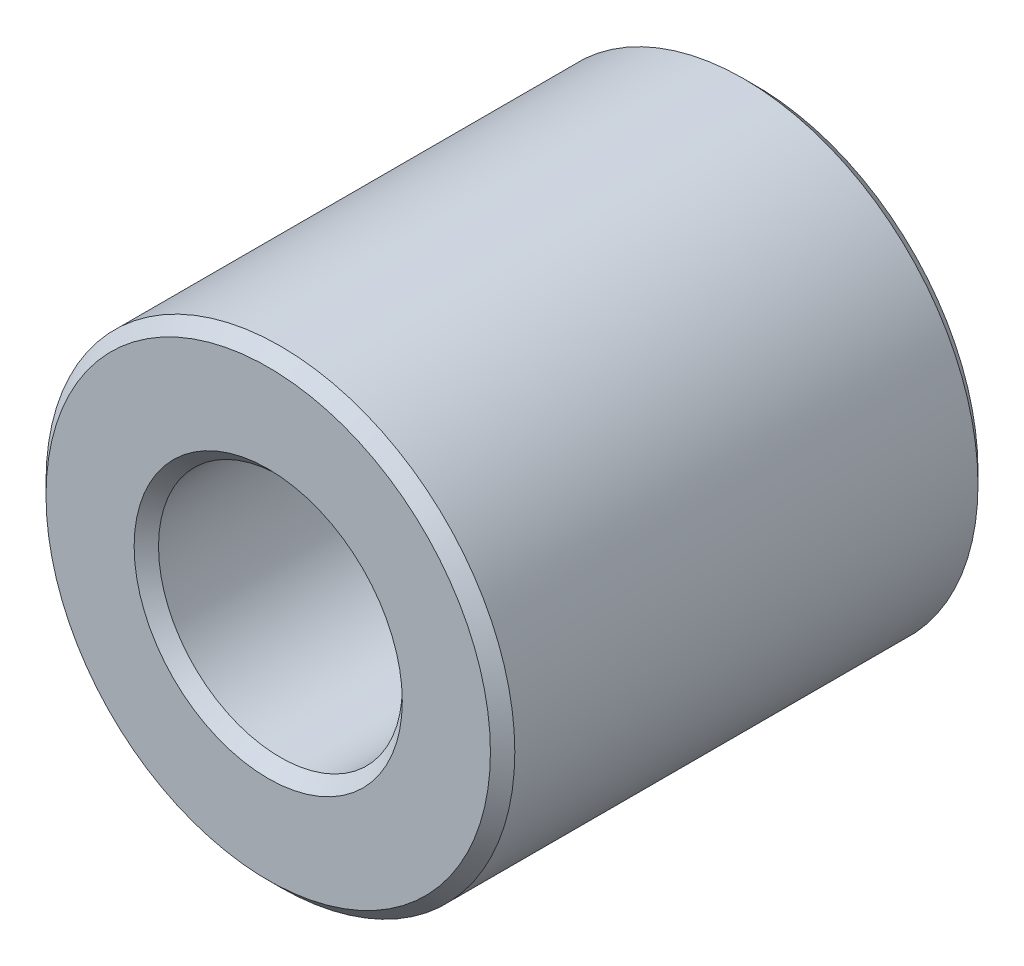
ISO-10303-21;
HEADER;
FILE_DESCRIPTION(('STEP AP214'),'2;1');
FILE_NAME('part.step','',(''),(''),'','','');
FILE_SCHEMA(('AUTOMOTIVE_DESIGN { 1 0 10303 214 1 1 1 1 }'));
ENDSEC;
DATA;
#1=APPLICATION_CONTEXT('core data for automotive mechanical design processes');
#2=APPLICATION_PROTOCOL_DEFINITION('international standard','automotive_design',2000,#1);
#3=PRODUCT_CONTEXT('',#1,'mechanical');
#4=PRODUCT('Part','Part','',(#3));
#5=PRODUCT_RELATED_PRODUCT_CATEGORY('part','',(#4));
#6=PRODUCT_DEFINITION_FORMATION('','',#4);
#7=PRODUCT_DEFINITION_CONTEXT('part definition',#1,'design');
#8=PRODUCT_DEFINITION('design','',#6,#7);
#9=PRODUCT_DEFINITION_SHAPE('','',#8);
#10=(LENGTH_UNIT() NAMED_UNIT(*) SI_UNIT(.MILLI.,.METRE.));
#11=(NAMED_UNIT(*) PLANE_ANGLE_UNIT() SI_UNIT($,.RADIAN.));
#12=(NAMED_UNIT(*) SI_UNIT($,.STERADIAN.) SOLID_ANGLE_UNIT());
#13=UNCERTAINTY_MEASURE_WITH_UNIT(LENGTH_MEASURE(1.E-05),#10,'distance_accuracy_value','');
#14=(GEOMETRIC_REPRESENTATION_CONTEXT(3) GLOBAL_UNCERTAINTY_ASSIGNED_CONTEXT((#13)) GLOBAL_UNIT_ASSIGNED_CONTEXT((#10,
#11,#12)) REPRESENTATION_CONTEXT('',''));
#15=CARTESIAN_POINT('',(0.,0.,0.));
#16=DIRECTION('',(0.,0.,1.));
#17=DIRECTION('',(1.,0.,0.));
#18=AXIS2_PLACEMENT_3D('',#15,#16,#17);
#19=CARTESIAN_POINT('',(0.,0.,26.));
#20=DIRECTION('',(0.,0.,1.));
#21=DIRECTION('',(1.,0.,0.));
#22=AXIS2_PLACEMENT_3D('',#19,#20,#21);
#23=PLANE('',#22);
#24=CARTESIAN_POINT('',(0.,0.,26.));
#25=DIRECTION('',(0.,0.,1.));
#26=DIRECTION('',(1.,0.,0.));
#27=AXIS2_PLACEMENT_3D('',#24,#25,#26);
#28=CIRCLE('',#27,14.3);
#29=CARTESIAN_POINT('',(14.3,0.,26.));
#30=VERTEX_POINT('',#29);
#31=EDGE_CURVE('E10',#30,#30,#28,.F.);
#32=ORIENTED_EDGE('',*,*,#31,.T.);
#33=EDGE_LOOP('',(#32));
#34=FACE_BOUND('',#33,.T.);
#35=CARTESIAN_POINT('',(0.,0.,26.));
#36=DIRECTION('',(0.,0.,1.));
#37=DIRECTION('',(1.,0.,0.));
#38=AXIS2_PLACEMENT_3D('',#35,#36,#37);
#39=CIRCLE('',#38,23.7);
#40=CARTESIAN_POINT('',(23.7,0.,26.));
#41=VERTEX_POINT('',#40);
#42=EDGE_CURVE('E45',#41,#41,#39,.T.);
#43=ORIENTED_EDGE('',*,*,#42,.T.);
#44=EDGE_LOOP('',(#43));
#45=FACE_BOUND('',#44,.T.);
#46=ADVANCED_FACE('F37',(#34,#45),#23,.T.);
#47=CARTESIAN_POINT('',(0.,0.,-26.));
#48=DIRECTION('',(0.,0.,1.));
#49=DIRECTION('',(1.,0.,0.));
#50=AXIS2_PLACEMENT_3D('',#47,#48,#49);
#51=PLANE('',#50);
#52=CARTESIAN_POINT('',(0.,0.,-26.));
#53=DIRECTION('',(0.,0.,1.));
#54=DIRECTION('',(1.,0.,0.));
#55=AXIS2_PLACEMENT_3D('',#52,#53,#54);
#56=CIRCLE('',#55,14.3);
#57=CARTESIAN_POINT('',(14.3,0.,-26.));
#58=VERTEX_POINT('',#57);
#59=EDGE_CURVE('E70',#58,#58,#56,.T.);
#60=ORIENTED_EDGE('',*,*,#59,.T.);
#61=EDGE_LOOP('',(#60));
#62=FACE_BOUND('',#61,.T.);
#63=CARTESIAN_POINT('',(0.,0.,-26.));
#64=DIRECTION('',(0.,0.,1.));
#65=DIRECTION('',(1.,0.,0.));
#66=AXIS2_PLACEMENT_3D('',#63,#64,#65);
#67=CIRCLE('',#66,23.7);
#68=CARTESIAN_POINT('',(23.7,0.,-26.));
#69=VERTEX_POINT('',#68);
#70=EDGE_CURVE('E74',#69,#69,#67,.F.);
#71=ORIENTED_EDGE('',*,*,#70,.T.);
#72=EDGE_LOOP('',(#71));
#73=FACE_BOUND('',#72,.T.);
#74=ADVANCED_FACE('F78',(#62,#73),#51,.F.);
#75=CARTESIAN_POINT('',(0.,0.,26.));
#76=DIRECTION('',(0.,0.,-1.));
#77=DIRECTION('',(-1.,0.,0.));
#78=AXIS2_PLACEMENT_3D('',#75,#76,#77);
#79=CYLINDRICAL_SURFACE('',#78,25.);
#80=CARTESIAN_POINT('',(0.,0.,-24.7));
#81=DIRECTION('',(0.,0.,1.));
#82=DIRECTION('',(1.,0.,0.));
#83=AXIS2_PLACEMENT_3D('',#80,#81,#82);
#84=CIRCLE('',#83,25.);
#85=CARTESIAN_POINT('',(-25.,0.,-24.7));
#86=VERTEX_POINT('',#85);
#87=EDGE_CURVE('E52',#86,#86,#84,.T.);
#88=CARTESIAN_POINT('',(0.,0.,24.7000000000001));
#89=DIRECTION('',(0.,0.,1.));
#90=DIRECTION('',(1.,0.,0.));
#91=AXIS2_PLACEMENT_3D('',#88,#89,#90);
#92=CIRCLE('',#91,25.);
#93=CARTESIAN_POINT('',(-25.,0.,24.7000000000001));
#94=VERTEX_POINT('',#93);
#95=EDGE_CURVE('E57',#94,#94,#92,.F.);
#96=CARTESIAN_POINT('',(-25.,0.,-24.7));
#97=CARTESIAN_POINT('',(-25.,0.,-24.1854166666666));
#98=CARTESIAN_POINT('',(-25.,0.,-23.6708333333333));
#99=CARTESIAN_POINT('',(-25.,0.,-22.6416666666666));
#100=CARTESIAN_POINT('',(-25.,0.,-22.1270833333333));
#101=CARTESIAN_POINT('',(-25.,0.,-21.0979166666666));
#102=CARTESIAN_POINT('',(-25.,0.,-20.5833333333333));
#103=CARTESIAN_POINT('',(-25.,0.,-19.5541666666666));
#104=CARTESIAN_POINT('',(-25.,0.,-19.0395833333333));
#105=CARTESIAN_POINT('',(-25.,0.,-18.0104166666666));
#106=CARTESIAN_POINT('',(-25.,0.,-17.4958333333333));
#107=CARTESIAN_POINT('',(-25.,0.,-16.4666666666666));
#108=CARTESIAN_POINT('',(-25.,0.,-15.9520833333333));
#109=CARTESIAN_POINT('',(-25.,0.,-14.9229166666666));
#110=CARTESIAN_POINT('',(-25.,0.,-14.4083333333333));
#111=CARTESIAN_POINT('',(-25.,0.,-13.3791666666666));
#112=CARTESIAN_POINT('',(-25.,0.,-12.8645833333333));
#113=CARTESIAN_POINT('',(-25.,0.,-11.8354166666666));
#114=CARTESIAN_POINT('',(-25.,0.,-11.3208333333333));
#115=CARTESIAN_POINT('',(-25.,0.,-10.2916666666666));
#116=CARTESIAN_POINT('',(-25.,0.,-9.7770833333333));
#117=CARTESIAN_POINT('',(-25.,0.,-8.74791666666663));
#118=CARTESIAN_POINT('',(-25.,0.,-8.2333333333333));
#119=CARTESIAN_POINT('',(-25.,0.,-7.20416666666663));
#120=CARTESIAN_POINT('',(-25.,0.,-6.6895833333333));
#121=CARTESIAN_POINT('',(-25.,0.,-5.66041666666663));
#122=CARTESIAN_POINT('',(-25.,0.,-5.1458333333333));
#123=CARTESIAN_POINT('',(-25.,0.,-4.11666666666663));
#124=CARTESIAN_POINT('',(-25.,0.,-3.6020833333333));
#125=CARTESIAN_POINT('',(-25.,0.,-2.57291666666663));
#126=CARTESIAN_POINT('',(-25.,0.,-2.0583333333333));
#127=CARTESIAN_POINT('',(-25.,0.,-1.02916666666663));
#128=CARTESIAN_POINT('',(-25.,0.,-0.514583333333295));
#129=CARTESIAN_POINT('',(-25.,0.,0.514583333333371));
#130=CARTESIAN_POINT('',(-25.,0.,1.0291666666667));
#131=CARTESIAN_POINT('',(-25.,0.,2.05833333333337));
#132=CARTESIAN_POINT('',(-25.,0.,2.57291666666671));
#133=CARTESIAN_POINT('',(-25.,0.,3.60208333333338));
#134=CARTESIAN_POINT('',(-25.,0.,4.11666666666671));
#135=CARTESIAN_POINT('',(-25.,0.,5.14583333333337));
#136=CARTESIAN_POINT('',(-25.,0.,5.66041666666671));
#137=CARTESIAN_POINT('',(-25.,0.,6.68958333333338));
#138=CARTESIAN_POINT('',(-25.,0.,7.20416666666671));
#139=CARTESIAN_POINT('',(-25.,0.,8.23333333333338));
#140=CARTESIAN_POINT('',(-25.,0.,8.74791666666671));
#141=CARTESIAN_POINT('',(-25.,0.,9.77708333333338));
#142=CARTESIAN_POINT('',(-25.,0.,10.2916666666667));
#143=CARTESIAN_POINT('',(-25.,0.,11.3208333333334));
#144=CARTESIAN_POINT('',(-25.,0.,11.8354166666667));
#145=CARTESIAN_POINT('',(-25.,0.,12.8645833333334));
#146=CARTESIAN_POINT('',(-25.,0.,13.3791666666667));
#147=CARTESIAN_POINT('',(-25.,0.,14.4083333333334));
#148=CARTESIAN_POINT('',(-25.,0.,14.9229166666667));
#149=CARTESIAN_POINT('',(-25.,0.,15.9520833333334));
#150=CARTESIAN_POINT('',(-25.,0.,16.4666666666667));
#151=CARTESIAN_POINT('',(-25.,0.,17.4958333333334));
#152=CARTESIAN_POINT('',(-25.,0.,18.0104166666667));
#153=CARTESIAN_POINT('',(-25.,0.,19.0395833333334));
#154=CARTESIAN_POINT('',(-25.,0.,19.5541666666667));
#155=CARTESIAN_POINT('',(-25.,0.,20.5833333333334));
#156=CARTESIAN_POINT('',(-25.,0.,21.0979166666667));
#157=CARTESIAN_POINT('',(-25.,0.,22.1270833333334));
#158=CARTESIAN_POINT('',(-25.,0.,22.6416666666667));
#159=CARTESIAN_POINT('',(-25.,0.,23.6708333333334));
#160=CARTESIAN_POINT('',(-25.,0.,24.1854166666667));
#161=CARTESIAN_POINT('',(-25.,0.,24.7000000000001));
#162=B_SPLINE_CURVE_WITH_KNOTS('',3,(#96,#97,#98,#99,#100,#101,#102,#103,#104,#105,#106,#107,
#108,#109,#110,#111,#112,#113,#114,#115,#116,#117,#118,#119,#120,#121,#122,#123,#124,#125,#126,
#127,#128,#129,#130,#131,#132,#133,#134,#135,#136,#137,#138,#139,#140,#141,#142,#143,#144,#145,
#146,#147,#148,#149,#150,#151,#152,#153,#154,#155,#156,#157,#158,#159,#160,#161),.UNSPECIFIED.,
.F.,.F.,(4,2,2,2,2,2,2,2,2,2,2,2,2,2,2,2,2,2,2,2,2,2,2,2,2,2,2,2,2,2,2,2,4),(0.,1.54375,3.0875,
4.63125,6.17500000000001,7.71875,9.26250000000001,10.80625,12.35,13.89375,15.4375,16.98125,
18.525,20.06875,21.6125,23.15625,24.7,26.24375,27.7875,29.33125,30.875,32.41875,33.9625,
35.50625,37.05,38.59375,40.1375,41.68125,43.225,44.76875,46.3125,47.85625,49.4),.UNSPECIFIED.);
#163=EDGE_CURVE('BSEAM88',#86,#94,#162,.T.);
#164=ORIENTED_EDGE('',*,*,#87,.T.);
#165=ORIENTED_EDGE('',*,*,#95,.T.);
#166=ORIENTED_EDGE('',*,*,#163,.T.);
#167=ORIENTED_EDGE('',*,*,#163,.F.);
#168=EDGE_LOOP('',(#164,#166,#165,#167));
#169=FACE_BOUND('',#168,.T.);
#170=ADVANCED_FACE('F88',(#169),#79,.T.);
#171=CARTESIAN_POINT('',(0.,0.,26.));
#172=DIRECTION('',(0.,0.,-1.));
#173=DIRECTION('',(-1.,0.,0.));
#174=AXIS2_PLACEMENT_3D('',#171,#172,#173);
#175=CYLINDRICAL_SURFACE('',#174,13.);
#176=CARTESIAN_POINT('',(0.,0.,-24.7));
#177=DIRECTION('',(0.,0.,1.));
#178=DIRECTION('',(1.,0.,0.));
#179=AXIS2_PLACEMENT_3D('',#176,#177,#178);
#180=CIRCLE('',#179,13.);
#181=CARTESIAN_POINT('',(-13.,0.,-24.7));
#182=VERTEX_POINT('',#181);
#183=EDGE_CURVE('E63',#182,#182,#180,.F.);
#184=CARTESIAN_POINT('',(0.,0.,24.7));
#185=DIRECTION('',(0.,0.,1.));
#186=DIRECTION('',(1.,0.,0.));
#187=AXIS2_PLACEMENT_3D('',#184,#185,#186);
#188=CIRCLE('',#187,13.);
#189=CARTESIAN_POINT('',(-13.,0.,24.7));
#190=VERTEX_POINT('',#189);
#191=EDGE_CURVE('E66',#190,#190,#188,.T.);
#192=CARTESIAN_POINT('',(-13.,0.,-24.7));
#193=CARTESIAN_POINT('',(-13.,0.,-24.1854166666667));
#194=CARTESIAN_POINT('',(-13.,0.,-23.6708333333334));
#195=CARTESIAN_POINT('',(-13.,0.,-22.6416666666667));
#196=CARTESIAN_POINT('',(-13.,0.,-22.1270833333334));
#197=CARTESIAN_POINT('',(-13.,0.,-21.0979166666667));
#198=CARTESIAN_POINT('',(-13.,0.,-20.5833333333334));
#199=CARTESIAN_POINT('',(-13.,0.,-19.5541666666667));
#200=CARTESIAN_POINT('',(-13.,0.,-19.0395833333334));
#201=CARTESIAN_POINT('',(-13.,0.,-18.0104166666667));
#202=CARTESIAN_POINT('',(-13.,0.,-17.4958333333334));
#203=CARTESIAN_POINT('',(-13.,0.,-16.4666666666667));
#204=CARTESIAN_POINT('',(-13.,0.,-15.9520833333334));
#205=CARTESIAN_POINT('',(-13.,0.,-14.9229166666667));
#206=CARTESIAN_POINT('',(-13.,0.,-14.4083333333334));
#207=CARTESIAN_POINT('',(-13.,0.,-13.3791666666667));
#208=CARTESIAN_POINT('',(-13.,0.,-12.8645833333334));
#209=CARTESIAN_POINT('',(-13.,0.,-11.8354166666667));
#210=CARTESIAN_POINT('',(-13.,0.,-11.3208333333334));
#211=CARTESIAN_POINT('',(-13.,0.,-10.2916666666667));
#212=CARTESIAN_POINT('',(-13.,0.,-9.77708333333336));
#213=CARTESIAN_POINT('',(-13.,0.,-8.7479166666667));
#214=CARTESIAN_POINT('',(-13.,0.,-8.23333333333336));
#215=CARTESIAN_POINT('',(-13.,0.,-7.2041666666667));
#216=CARTESIAN_POINT('',(-13.,0.,-6.68958333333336));
#217=CARTESIAN_POINT('',(-13.,0.,-5.6604166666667));
#218=CARTESIAN_POINT('',(-13.,0.,-5.14583333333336));
#219=CARTESIAN_POINT('',(-13.,0.,-4.1166666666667));
#220=CARTESIAN_POINT('',(-13.,0.,-3.60208333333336));
#221=CARTESIAN_POINT('',(-13.,0.,-2.5729166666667));
#222=CARTESIAN_POINT('',(-13.,0.,-2.05833333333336));
#223=CARTESIAN_POINT('',(-13.,0.,-1.0291666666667));
#224=CARTESIAN_POINT('',(-13.,0.,-0.514583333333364));
#225=CARTESIAN_POINT('',(-13.,0.,0.514583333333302));
#226=CARTESIAN_POINT('',(-13.,0.,1.02916666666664));
#227=CARTESIAN_POINT('',(-13.,0.,2.0583333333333));
#228=CARTESIAN_POINT('',(-13.,0.,2.57291666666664));
#229=CARTESIAN_POINT('',(-13.,0.,3.6020833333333));
#230=CARTESIAN_POINT('',(-13.,0.,4.11666666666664));
#231=CARTESIAN_POINT('',(-13.,0.,5.1458333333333));
#232=CARTESIAN_POINT('',(-13.,0.,5.66041666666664));
#233=CARTESIAN_POINT('',(-13.,0.,6.6895833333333));
#234=CARTESIAN_POINT('',(-13.,0.,7.20416666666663));
#235=CARTESIAN_POINT('',(-13.,0.,8.2333333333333));
#236=CARTESIAN_POINT('',(-13.,0.,8.74791666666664));
#237=CARTESIAN_POINT('',(-13.,0.,9.77708333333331));
#238=CARTESIAN_POINT('',(-13.,0.,10.2916666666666));
#239=CARTESIAN_POINT('',(-13.,0.,11.3208333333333));
#240=CARTESIAN_POINT('',(-13.,0.,11.8354166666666));
#241=CARTESIAN_POINT('',(-13.,0.,12.8645833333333));
#242=CARTESIAN_POINT('',(-13.,0.,13.3791666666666));
#243=CARTESIAN_POINT('',(-13.,0.,14.4083333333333));
#244=CARTESIAN_POINT('',(-13.,0.,14.9229166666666));
#245=CARTESIAN_POINT('',(-13.,0.,15.9520833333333));
#246=CARTESIAN_POINT('',(-13.,0.,16.4666666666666));
#247=CARTESIAN_POINT('',(-13.,0.,17.4958333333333));
#248=CARTESIAN_POINT('',(-13.,0.,18.0104166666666));
#249=CARTESIAN_POINT('',(-13.,0.,19.0395833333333));
#250=CARTESIAN_POINT('',(-13.,0.,19.5541666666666));
#251=CARTESIAN_POINT('',(-13.,0.,20.5833333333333));
#252=CARTESIAN_POINT('',(-13.,0.,21.0979166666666));
#253=CARTESIAN_POINT('',(-13.,0.,22.1270833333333));
#254=CARTESIAN_POINT('',(-13.,0.,22.6416666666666));
#255=CARTESIAN_POINT('',(-13.,0.,23.6708333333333));
#256=CARTESIAN_POINT('',(-13.,0.,24.1854166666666));
#257=CARTESIAN_POINT('',(-13.,0.,24.7));
#258=B_SPLINE_CURVE_WITH_KNOTS('',3,(#192,#193,#194,#195,#196,#197,#198,#199,#200,#201,#202,
#203,#204,#205,#206,#207,#208,#209,#210,#211,#212,#213,#214,#215,#216,#217,#218,#219,#220,#221,
#222,#223,#224,#225,#226,#227,#228,#229,#230,#231,#232,#233,#234,#235,#236,#237,#238,#239,#240,
#241,#242,#243,#244,#245,#246,#247,#248,#249,#250,#251,#252,#253,#254,#255,#256,#257),
.UNSPECIFIED.,.F.,.F.,(4,2,2,2,2,2,2,2,2,2,2,2,2,2,2,2,2,2,2,2,2,2,2,2,2,2,2,2,2,2,2,2,4),(0.,
1.54375,3.0875,4.63125,6.175,7.71875,9.2625,10.80625,12.35,13.89375,15.4375,16.98125,18.525,
20.06875,21.6125,23.15625,24.7,26.24375,27.7875,29.33125,30.875,32.41875,33.9625,35.50625,37.05,
38.59375,40.1375,41.68125,43.225,44.76875,46.3125,47.85625,49.4),.UNSPECIFIED.);
#259=EDGE_CURVE('BSEAM91',#182,#190,#258,.T.);
#260=ORIENTED_EDGE('',*,*,#183,.T.);
#261=ORIENTED_EDGE('',*,*,#191,.T.);
#262=ORIENTED_EDGE('',*,*,#259,.T.);
#263=ORIENTED_EDGE('',*,*,#259,.F.);
#264=EDGE_LOOP('',(#260,#262,#261,#263));
#265=FACE_BOUND('',#264,.T.);
#266=ADVANCED_FACE('F91',(#265),#175,.F.);
#267=CARTESIAN_POINT('',(0.,0.,-26.));
#268=DIRECTION('',(0.,0.,-1.));
#269=DIRECTION('',(-1.,0.,0.));
#270=AXIS2_PLACEMENT_3D('',#267,#268,#269);
#271=CONICAL_SURFACE('',#270,14.3,0.785398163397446);
#272=ORIENTED_EDGE('',*,*,#183,.F.);
#273=EDGE_LOOP('',(#272));
#274=FACE_BOUND('',#273,.T.);
#275=ORIENTED_EDGE('',*,*,#59,.F.);
#276=EDGE_LOOP('',(#275));
#277=FACE_BOUND('',#276,.T.);
#278=ADVANCED_FACE('F84',(#274,#277),#271,.F.);
#279=CARTESIAN_POINT('',(0.,0.,-24.7));
#280=DIRECTION('',(0.,0.,1.));
#281=DIRECTION('',(1.,0.,0.));
#282=AXIS2_PLACEMENT_3D('',#279,#280,#281);
#283=CONICAL_SURFACE('',#282,25.,0.78539816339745);
#284=ORIENTED_EDGE('',*,*,#70,.F.);
#285=EDGE_LOOP('',(#284));
#286=FACE_BOUND('',#285,.T.);
#287=ORIENTED_EDGE('',*,*,#87,.F.);
#288=EDGE_LOOP('',(#287));
#289=FACE_BOUND('',#288,.T.);
#290=ADVANCED_FACE('F80',(#286,#289),#283,.T.);
#291=CARTESIAN_POINT('',(0.,0.,24.7));
#292=DIRECTION('',(0.,0.,1.));
#293=DIRECTION('',(1.,0.,0.));
#294=AXIS2_PLACEMENT_3D('',#291,#292,#293);
#295=CONICAL_SURFACE('',#294,13.,0.785398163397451);
#296=ORIENTED_EDGE('',*,*,#31,.F.);
#297=EDGE_LOOP('',(#296));
#298=FACE_BOUND('',#297,.T.);
#299=ORIENTED_EDGE('',*,*,#191,.F.);
#300=EDGE_LOOP('',(#299));
#301=FACE_BOUND('',#300,.T.);
#302=ADVANCED_FACE('F83',(#298,#301),#295,.F.);
#303=CARTESIAN_POINT('',(0.,0.,26.));
#304=DIRECTION('',(0.,0.,-1.));
#305=DIRECTION('',(-1.,0.,0.));
#306=AXIS2_PLACEMENT_3D('',#303,#304,#305);
#307=CONICAL_SURFACE('',#306,23.7,0.785398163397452);
#308=ORIENTED_EDGE('',*,*,#95,.F.);
#309=EDGE_LOOP('',(#308));
#310=FACE_BOUND('',#309,.T.);
#311=ORIENTED_EDGE('',*,*,#42,.F.);
#312=EDGE_LOOP('',(#311));
#313=FACE_BOUND('',#312,.T.);
#314=ADVANCED_FACE('F39',(#310,#313),#307,.T.);
#315=CLOSED_SHELL('',(#46,#74,#170,#266,#278,#290,#302,#314));
#316=MANIFOLD_SOLID_BREP('B2',#315);
#317=ADVANCED_BREP_SHAPE_REPRESENTATION('',(#18,#316),#14);
#318=SHAPE_DEFINITION_REPRESENTATION(#9,#317);
ENDSEC;
END-ISO-10303-21;
